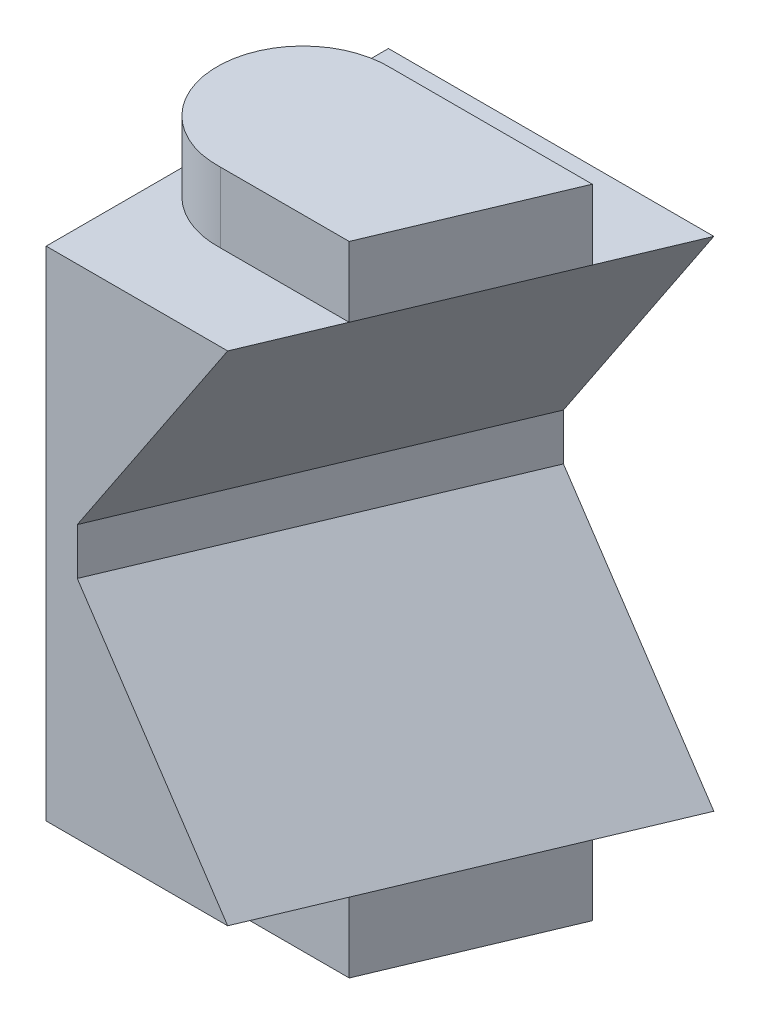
ISO-10303-21;
HEADER;
FILE_DESCRIPTION(('STEP AP214'),'2;1');
FILE_NAME('part.step','',(''),(''),'','','');
FILE_SCHEMA(('AUTOMOTIVE_DESIGN { 1 0 10303 214 1 1 1 1 }'));
ENDSEC;
DATA;
#1=APPLICATION_CONTEXT('core data for automotive mechanical design processes');
#2=APPLICATION_PROTOCOL_DEFINITION('international standard','automotive_design',2000,#1);
#3=PRODUCT_CONTEXT('',#1,'mechanical');
#4=PRODUCT('Part','Part','',(#3));
#5=PRODUCT_RELATED_PRODUCT_CATEGORY('part','',(#4));
#6=PRODUCT_DEFINITION_FORMATION('','',#4);
#7=PRODUCT_DEFINITION_CONTEXT('part definition',#1,'design');
#8=PRODUCT_DEFINITION('design','',#6,#7);
#9=PRODUCT_DEFINITION_SHAPE('','',#8);
#10=(LENGTH_UNIT() NAMED_UNIT(*) SI_UNIT(.MILLI.,.METRE.));
#11=(NAMED_UNIT(*) PLANE_ANGLE_UNIT() SI_UNIT($,.RADIAN.));
#12=(NAMED_UNIT(*) SI_UNIT($,.STERADIAN.) SOLID_ANGLE_UNIT());
#13=UNCERTAINTY_MEASURE_WITH_UNIT(LENGTH_MEASURE(1.E-05),#10,'distance_accuracy_value','');
#14=(GEOMETRIC_REPRESENTATION_CONTEXT(3) GLOBAL_UNCERTAINTY_ASSIGNED_CONTEXT((#13)) GLOBAL_UNIT_ASSIGNED_CONTEXT((#10,
#11,#12)) REPRESENTATION_CONTEXT('',''));
#15=CARTESIAN_POINT('',(0.,0.,0.));
#16=DIRECTION('',(0.,0.,1.));
#17=DIRECTION('',(1.,0.,0.));
#18=AXIS2_PLACEMENT_3D('',#15,#16,#17);
#19=CARTESIAN_POINT('',(21.,16.,0.));
#20=DIRECTION('',(0.,1.,0.));
#21=DIRECTION('',(0.,0.,1.));
#22=AXIS2_PLACEMENT_3D('',#19,#20,#21);
#23=PLANE('',#22);
#24=DIRECTION('',(1.,0.,0.));
#25=VECTOR('',#24,1.);
#26=CARTESIAN_POINT('',(5.70193852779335,16.,5.5));
#27=LINE('',#26,#25);
#28=CARTESIAN_POINT('',(5.70193852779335,16.,5.5));
#29=VERTEX_POINT('',#28);
#30=CARTESIAN_POINT('',(18.6026280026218,16.,5.5));
#31=VERTEX_POINT('',#30);
#32=EDGE_CURVE('E25',#29,#31,#27,.T.);
#33=ORIENTED_EDGE('',*,*,#32,.T.);
#34=DIRECTION('',(-0.3875155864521,0.,0.921863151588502));
#35=VECTOR('',#34,1.);
#36=CARTESIAN_POINT('',(20.9146151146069,16.,0.));
#37=LINE('',#36,#35);
#38=CARTESIAN_POINT('',(20.9146151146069,16.,0.));
#39=VERTEX_POINT('',#38);
#40=EDGE_CURVE('E184',#39,#31,#37,.T.);
#41=ORIENTED_EDGE('',*,*,#40,.F.);
#42=CARTESIAN_POINT('',(20.2479484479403,16.,0.));
#43=DIRECTION('',(1.,0.,0.));
#44=VECTOR('',#43,1.);
#45=LINE('',#42,#44);
#46=CARTESIAN_POINT('',(20.2479484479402,16.,0.));
#47=VERTEX_POINT('',#46);
#48=EDGE_CURVE('E379',#47,#39,#45,.T.);
#49=ORIENTED_EDGE('',*,*,#48,.F.);
#50=DIRECTION('',(-1.,0.,0.));
#51=VECTOR('',#50,1.);
#52=CARTESIAN_POINT('',(20.2479484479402,16.,0.));
#53=LINE('',#52,#51);
#54=CARTESIAN_POINT('',(0.,16.,0.));
#55=VERTEX_POINT('',#54);
#56=EDGE_CURVE('E436',#47,#55,#53,.T.);
#57=ORIENTED_EDGE('',*,*,#56,.T.);
#58=DIRECTION('',(0.,0.,1.));
#59=VECTOR('',#58,1.);
#60=CARTESIAN_POINT('',(0.,16.,22.));
#61=LINE('',#60,#59);
#62=CARTESIAN_POINT('',(0.,16.,11.));
#63=VERTEX_POINT('',#62);
#64=EDGE_CURVE('E437',#55,#63,#61,.T.);
#65=ORIENTED_EDGE('',*,*,#64,.T.);
#66=CARTESIAN_POINT('',(5.50357577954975,16.,11.));
#67=DIRECTION('',(0.,1.,0.));
#68=DIRECTION('',(0.,0.,1.));
#69=AXIS2_PLACEMENT_3D('',#66,#67,#68);
#70=CIRCLE('',#69,5.5035759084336);
#71=EDGE_CURVE('E439',#63,#29,#70,.F.);
#72=ORIENTED_EDGE('',*,*,#71,.T.);
#73=EDGE_LOOP('',(#33,#41,#49,#57,#65,#72));
#74=FACE_BOUND('',#73,.T.);
#75=ADVANCED_FACE('F14',(#74),#23,.T.);
#76=CARTESIAN_POINT('',(13.9786537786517,16.,16.5));
#77=VERTEX_POINT('',#76);
#78=CARTESIAN_POINT('',(11.6666666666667,16.,22.));
#79=VERTEX_POINT('',#78);
#80=EDGE_CURVE('E19',#77,#79,#37,.T.);
#81=ORIENTED_EDGE('',*,*,#80,.F.);
#82=DIRECTION('',(-1.,0.,0.));
#83=VECTOR('',#82,1.);
#84=CARTESIAN_POINT('',(5.70193852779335,16.,16.5));
#85=LINE('',#84,#83);
#86=CARTESIAN_POINT('',(5.70193852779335,16.,16.5));
#87=VERTEX_POINT('',#86);
#88=EDGE_CURVE('E33',#77,#87,#85,.T.);
#89=ORIENTED_EDGE('',*,*,#88,.T.);
#90=EDGE_CURVE('E484',#87,#63,#70,.F.);
#91=ORIENTED_EDGE('',*,*,#90,.T.);
#92=CARTESIAN_POINT('',(0.,16.,22.));
#93=VERTEX_POINT('',#92);
#94=EDGE_CURVE('E435',#63,#93,#61,.T.);
#95=ORIENTED_EDGE('',*,*,#94,.T.);
#96=DIRECTION('',(1.,0.,0.));
#97=VECTOR('',#96,1.);
#98=CARTESIAN_POINT('',(0.,16.,22.));
#99=LINE('',#98,#97);
#100=CARTESIAN_POINT('',(11.,16.,22.));
#101=VERTEX_POINT('',#100);
#102=EDGE_CURVE('E431',#93,#101,#99,.T.);
#103=ORIENTED_EDGE('',*,*,#102,.T.);
#104=CARTESIAN_POINT('',(11.6666666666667,16.,22.));
#105=DIRECTION('',(-1.,0.,0.));
#106=VECTOR('',#105,1.);
#107=LINE('',#104,#106);
#108=EDGE_CURVE('E366',#79,#101,#107,.T.);
#109=ORIENTED_EDGE('',*,*,#108,.F.);
#110=EDGE_LOOP('',(#81,#89,#91,#95,#103,#109));
#111=FACE_BOUND('',#110,.T.);
#112=ADVANCED_FACE('F284',(#111),#23,.T.);
#113=CARTESIAN_POINT('',(21.,-16.,0.));
#114=DIRECTION('',(0.,-1.,0.));
#115=DIRECTION('',(0.,0.,-1.));
#116=AXIS2_PLACEMENT_3D('',#113,#114,#115);
#117=PLANE('',#116);
#118=DIRECTION('',(-0.387515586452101,0.,0.921863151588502));
#119=VECTOR('',#118,1.);
#120=CARTESIAN_POINT('',(20.9146151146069,-16.,0.));
#121=LINE('',#120,#119);
#122=CARTESIAN_POINT('',(20.9146151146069,-16.,0.));
#123=VERTEX_POINT('',#122);
#124=CARTESIAN_POINT('',(18.6026280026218,-16.,5.5));
#125=VERTEX_POINT('',#124);
#126=EDGE_CURVE('E189',#123,#125,#121,.T.);
#127=ORIENTED_EDGE('',*,*,#126,.T.);
#128=DIRECTION('',(1.,0.,0.));
#129=VECTOR('',#128,1.);
#130=CARTESIAN_POINT('',(5.70193852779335,-16.,5.5));
#131=LINE('',#130,#129);
#132=CARTESIAN_POINT('',(5.70193852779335,-16.,5.5));
#133=VERTEX_POINT('',#132);
#134=EDGE_CURVE('E486',#133,#125,#131,.T.);
#135=ORIENTED_EDGE('',*,*,#134,.F.);
#136=CARTESIAN_POINT('',(5.50357577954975,-16.,11.));
#137=DIRECTION('',(0.,-1.,0.));
#138=DIRECTION('',(0.,0.,-1.));
#139=AXIS2_PLACEMENT_3D('',#136,#137,#138);
#140=CIRCLE('',#139,5.5035759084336);
#141=CARTESIAN_POINT('',(0.,-16.,11.));
#142=VERTEX_POINT('',#141);
#143=EDGE_CURVE('E487',#142,#133,#140,.T.);
#144=ORIENTED_EDGE('',*,*,#143,.F.);
#145=DIRECTION('',(0.,0.,-1.));
#146=VECTOR('',#145,1.);
#147=CARTESIAN_POINT('',(0.,-16.,22.));
#148=LINE('',#147,#146);
#149=CARTESIAN_POINT('',(0.,-16.,0.));
#150=VERTEX_POINT('',#149);
#151=EDGE_CURVE('E353',#142,#150,#148,.T.);
#152=ORIENTED_EDGE('',*,*,#151,.T.);
#153=DIRECTION('',(1.,0.,0.));
#154=VECTOR('',#153,1.);
#155=CARTESIAN_POINT('',(0.,-16.,0.));
#156=LINE('',#155,#154);
#157=CARTESIAN_POINT('',(20.2479484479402,-16.,0.));
#158=VERTEX_POINT('',#157);
#159=EDGE_CURVE('E357',#150,#158,#156,.T.);
#160=ORIENTED_EDGE('',*,*,#159,.T.);
#161=CARTESIAN_POINT('',(20.9146151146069,-16.,0.));
#162=DIRECTION('',(-1.,0.,0.));
#163=VECTOR('',#162,1.);
#164=LINE('',#161,#163);
#165=EDGE_CURVE('E256',#123,#158,#164,.T.);
#166=ORIENTED_EDGE('',*,*,#165,.F.);
#167=EDGE_LOOP('',(#127,#135,#144,#152,#160,#166));
#168=FACE_BOUND('',#167,.T.);
#169=ADVANCED_FACE('F273',(#168),#117,.T.);
#170=DIRECTION('',(-1.,0.,0.));
#171=VECTOR('',#170,1.);
#172=CARTESIAN_POINT('',(5.70193852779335,-16.,16.5));
#173=LINE('',#172,#171);
#174=CARTESIAN_POINT('',(13.9786537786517,-16.,16.5));
#175=VERTEX_POINT('',#174);
#176=CARTESIAN_POINT('',(5.70193852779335,-16.,16.5));
#177=VERTEX_POINT('',#176);
#178=EDGE_CURVE('E9',#175,#177,#173,.T.);
#179=ORIENTED_EDGE('',*,*,#178,.F.);
#180=CARTESIAN_POINT('',(11.6666666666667,-16.,22.));
#181=VERTEX_POINT('',#180);
#182=EDGE_CURVE('E186',#175,#181,#121,.T.);
#183=ORIENTED_EDGE('',*,*,#182,.T.);
#184=CARTESIAN_POINT('',(11.,-16.,22.));
#185=DIRECTION('',(1.,0.,0.));
#186=VECTOR('',#185,1.);
#187=LINE('',#184,#186);
#188=CARTESIAN_POINT('',(11.,-16.,22.));
#189=VERTEX_POINT('',#188);
#190=EDGE_CURVE('E242',#189,#181,#187,.T.);
#191=ORIENTED_EDGE('',*,*,#190,.F.);
#192=DIRECTION('',(-1.,0.,0.));
#193=VECTOR('',#192,1.);
#194=CARTESIAN_POINT('',(11.,-16.,22.));
#195=LINE('',#194,#193);
#196=CARTESIAN_POINT('',(0.,-16.,22.));
#197=VERTEX_POINT('',#196);
#198=EDGE_CURVE('E351',#189,#197,#195,.T.);
#199=ORIENTED_EDGE('',*,*,#198,.T.);
#200=EDGE_CURVE('E196',#197,#142,#148,.T.);
#201=ORIENTED_EDGE('',*,*,#200,.T.);
#202=EDGE_CURVE('E359',#177,#142,#140,.T.);
#203=ORIENTED_EDGE('',*,*,#202,.F.);
#204=EDGE_LOOP('',(#179,#183,#191,#199,#201,#203));
#205=FACE_BOUND('',#204,.T.);
#206=ADVANCED_FACE('F283',(#205),#117,.T.);
#207=CARTESIAN_POINT('',(0.,15.,0.));
#208=DIRECTION('',(0.,0.,-1.));
#209=DIRECTION('',(-1.,0.,0.));
#210=AXIS2_PLACEMENT_3D('',#207,#208,#209);
#211=PLANE('',#210);
#212=DIRECTION('',(-0.554700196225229,0.832050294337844,0.));
#213=VECTOR('',#212,1.);
#214=CARTESIAN_POINT('',(20.2479484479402,-15.,0.));
#215=LINE('',#214,#213);
#216=CARTESIAN_POINT('',(20.2479484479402,-15.,0.));
#217=VERTEX_POINT('',#216);
#218=CARTESIAN_POINT('',(11.2479484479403,-1.5,0.));
#219=VERTEX_POINT('',#218);
#220=EDGE_CURVE('E329',#217,#219,#215,.T.);
#221=ORIENTED_EDGE('',*,*,#220,.F.);
#222=CARTESIAN_POINT('',(20.2479484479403,-15.,0.));
#223=DIRECTION('',(0.554700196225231,-0.832050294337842,0.));
#224=VECTOR('',#223,1.);
#225=LINE('',#222,#224);
#226=EDGE_CURVE('E193',#217,#123,#225,.T.);
#227=ORIENTED_EDGE('',*,*,#226,.T.);
#228=ORIENTED_EDGE('',*,*,#165,.T.);
#229=ORIENTED_EDGE('',*,*,#159,.F.);
#230=DIRECTION('',(0.,1.,0.));
#231=VECTOR('',#230,1.);
#232=CARTESIAN_POINT('',(0.,-15.,0.));
#233=LINE('',#232,#231);
#234=EDGE_CURVE('E470',#150,#55,#233,.T.);
#235=ORIENTED_EDGE('',*,*,#234,.T.);
#236=ORIENTED_EDGE('',*,*,#56,.F.);
#237=ORIENTED_EDGE('',*,*,#48,.T.);
#238=CARTESIAN_POINT('',(20.9146151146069,16.,0.));
#239=DIRECTION('',(-0.554700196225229,-0.832050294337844,0.));
#240=VECTOR('',#239,1.);
#241=LINE('',#238,#240);
#242=CARTESIAN_POINT('',(20.2479484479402,15.,0.));
#243=VERTEX_POINT('',#242);
#244=EDGE_CURVE('E354',#39,#243,#241,.T.);
#245=ORIENTED_EDGE('',*,*,#244,.T.);
#246=DIRECTION('',(-0.554700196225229,-0.832050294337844,0.));
#247=VECTOR('',#246,1.);
#248=CARTESIAN_POINT('',(20.2479484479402,15.,0.));
#249=LINE('',#248,#247);
#250=CARTESIAN_POINT('',(11.2479484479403,1.5,0.));
#251=VERTEX_POINT('',#250);
#252=EDGE_CURVE('E450',#243,#251,#249,.T.);
#253=ORIENTED_EDGE('',*,*,#252,.T.);
#254=DIRECTION('',(0.,1.,0.));
#255=VECTOR('',#254,1.);
#256=CARTESIAN_POINT('',(11.2479484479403,-1.5,0.));
#257=LINE('',#256,#255);
#258=EDGE_CURVE('E332',#219,#251,#257,.T.);
#259=ORIENTED_EDGE('',*,*,#258,.F.);
#260=EDGE_LOOP('',(#221,#227,#228,#229,#235,#236,#237,#245,#253,#259));
#261=FACE_BOUND('',#260,.T.);
#262=ADVANCED_FACE('F16',(#261),#211,.T.);
#263=CARTESIAN_POINT('',(11.,15.,22.));
#264=DIRECTION('',(0.,0.,1.));
#265=DIRECTION('',(1.,0.,0.));
#266=AXIS2_PLACEMENT_3D('',#263,#264,#265);
#267=PLANE('',#266);
#268=DIRECTION('',(-0.554700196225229,-0.832050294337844,0.));
#269=VECTOR('',#268,1.);
#270=CARTESIAN_POINT('',(11.,15.,22.));
#271=LINE('',#270,#269);
#272=CARTESIAN_POINT('',(11.,15.,22.));
#273=VERTEX_POINT('',#272);
#274=CARTESIAN_POINT('',(2.,1.5,22.));
#275=VERTEX_POINT('',#274);
#276=EDGE_CURVE('E448',#273,#275,#271,.T.);
#277=ORIENTED_EDGE('',*,*,#276,.F.);
#278=CARTESIAN_POINT('',(11.,15.,22.));
#279=DIRECTION('',(0.554700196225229,0.832050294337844,0.));
#280=VECTOR('',#279,1.);
#281=LINE('',#278,#280);
#282=EDGE_CURVE('E180',#273,#79,#281,.T.);
#283=ORIENTED_EDGE('',*,*,#282,.T.);
#284=ORIENTED_EDGE('',*,*,#108,.T.);
#285=ORIENTED_EDGE('',*,*,#102,.F.);
#286=DIRECTION('',(0.,-1.,0.));
#287=VECTOR('',#286,1.);
#288=CARTESIAN_POINT('',(0.,15.,22.));
#289=LINE('',#288,#287);
#290=EDGE_CURVE('E472',#93,#197,#289,.T.);
#291=ORIENTED_EDGE('',*,*,#290,.T.);
#292=ORIENTED_EDGE('',*,*,#198,.F.);
#293=ORIENTED_EDGE('',*,*,#190,.T.);
#294=CARTESIAN_POINT('',(11.6666666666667,-16.,22.));
#295=DIRECTION('',(-0.55470019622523,0.832050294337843,0.));
#296=VECTOR('',#295,1.);
#297=LINE('',#294,#296);
#298=CARTESIAN_POINT('',(11.,-15.,22.));
#299=VERTEX_POINT('',#298);
#300=EDGE_CURVE('E666',#181,#299,#297,.T.);
#301=ORIENTED_EDGE('',*,*,#300,.T.);
#302=DIRECTION('',(-0.554700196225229,0.832050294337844,0.));
#303=VECTOR('',#302,1.);
#304=CARTESIAN_POINT('',(11.,-15.,22.));
#305=LINE('',#304,#303);
#306=CARTESIAN_POINT('',(2.,-1.5,22.));
#307=VERTEX_POINT('',#306);
#308=EDGE_CURVE('E334',#299,#307,#305,.T.);
#309=ORIENTED_EDGE('',*,*,#308,.T.);
#310=DIRECTION('',(0.,1.,0.));
#311=VECTOR('',#310,1.);
#312=CARTESIAN_POINT('',(2.,-1.5,22.));
#313=LINE('',#312,#311);
#314=EDGE_CURVE('E459',#307,#275,#313,.T.);
#315=ORIENTED_EDGE('',*,*,#314,.T.);
#316=EDGE_LOOP('',(#277,#283,#284,#285,#291,#292,#293,#301,#309,#315));
#317=FACE_BOUND('',#316,.T.);
#318=ADVANCED_FACE('F205',(#317),#267,.T.);
#319=CARTESIAN_POINT('',(20.2479484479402,15.,0.));
#320=DIRECTION('',(0.785395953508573,-0.523597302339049,0.330150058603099));
#321=DIRECTION('',(0.554700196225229,0.832050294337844,0.));
#322=AXIS2_PLACEMENT_3D('',#319,#320,#321);
#323=PLANE('',#322);
#324=ORIENTED_EDGE('',*,*,#252,.F.);
#325=ORIENTED_EDGE('',*,*,#244,.F.);
#326=ORIENTED_EDGE('',*,*,#40,.T.);
#327=DIRECTION('',(0.387515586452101,0.,-0.921863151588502));
#328=VECTOR('',#327,1.);
#329=CARTESIAN_POINT('',(13.9786537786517,16.,16.5));
#330=LINE('',#329,#328);
#331=EDGE_CURVE('E162',#77,#31,#330,.T.);
#332=ORIENTED_EDGE('',*,*,#331,.F.);
#333=ORIENTED_EDGE('',*,*,#80,.T.);
#334=ORIENTED_EDGE('',*,*,#282,.F.);
#335=ORIENTED_EDGE('',*,*,#276,.T.);
#336=DIRECTION('',(0.387515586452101,0.,-0.921863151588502));
#337=VECTOR('',#336,1.);
#338=CARTESIAN_POINT('',(2.,1.5,22.));
#339=LINE('',#338,#337);
#340=EDGE_CURVE('E451',#275,#251,#339,.T.);
#341=ORIENTED_EDGE('',*,*,#340,.T.);
#342=EDGE_LOOP('',(#324,#325,#326,#332,#333,#334,#335,#341));
#343=FACE_BOUND('',#342,.T.);
#344=ADVANCED_FACE('F214',(#343),#323,.T.);
#345=CARTESIAN_POINT('',(11.2479484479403,-1.5,0.));
#346=DIRECTION('',(-0.921863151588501,0.,-0.387515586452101));
#347=DIRECTION('',(-0.387515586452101,0.,0.921863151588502));
#348=AXIS2_PLACEMENT_3D('',#345,#346,#347);
#349=PLANE('',#348);
#350=ORIENTED_EDGE('',*,*,#314,.F.);
#351=DIRECTION('',(-0.387515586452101,0.,0.921863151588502));
#352=VECTOR('',#351,1.);
#353=CARTESIAN_POINT('',(11.2479484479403,-1.5,0.));
#354=LINE('',#353,#352);
#355=EDGE_CURVE('E338',#219,#307,#354,.T.);
#356=ORIENTED_EDGE('',*,*,#355,.F.);
#357=ORIENTED_EDGE('',*,*,#258,.T.);
#358=ORIENTED_EDGE('',*,*,#340,.F.);
#359=EDGE_LOOP('',(#350,#356,#357,#358));
#360=FACE_BOUND('',#359,.T.);
#361=ADVANCED_FACE('F216',(#360),#349,.F.);
#362=CARTESIAN_POINT('',(11.,-15.,22.));
#363=DIRECTION('',(0.785395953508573,0.523597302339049,0.330150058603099));
#364=DIRECTION('',(-0.554700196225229,0.832050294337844,0.));
#365=AXIS2_PLACEMENT_3D('',#362,#363,#364);
#366=PLANE('',#365);
#367=ORIENTED_EDGE('',*,*,#308,.F.);
#368=ORIENTED_EDGE('',*,*,#300,.F.);
#369=ORIENTED_EDGE('',*,*,#182,.F.);
#370=DIRECTION('',(-0.387515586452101,0.,0.921863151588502));
#371=VECTOR('',#370,1.);
#372=CARTESIAN_POINT('',(13.9786537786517,-16.,16.5));
#373=LINE('',#372,#371);
#374=EDGE_CURVE('E171',#125,#175,#373,.T.);
#375=ORIENTED_EDGE('',*,*,#374,.F.);
#376=ORIENTED_EDGE('',*,*,#126,.F.);
#377=ORIENTED_EDGE('',*,*,#226,.F.);
#378=ORIENTED_EDGE('',*,*,#220,.T.);
#379=ORIENTED_EDGE('',*,*,#355,.T.);
#380=EDGE_LOOP('',(#367,#368,#369,#375,#376,#377,#378,#379));
#381=FACE_BOUND('',#380,.T.);
#382=ADVANCED_FACE('F305',(#381),#366,.T.);
#383=CARTESIAN_POINT('',(5.50357577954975,-19.5,11.));
#384=DIRECTION('',(0.,1.,0.));
#385=DIRECTION('',(0.,0.,1.));
#386=AXIS2_PLACEMENT_3D('',#383,#384,#385);
#387=CYLINDRICAL_SURFACE('',#386,5.5035759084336);
#388=ORIENTED_EDGE('',*,*,#202,.T.);
#389=ORIENTED_EDGE('',*,*,#143,.T.);
#390=DIRECTION('',(0.,1.,0.));
#391=VECTOR('',#390,1.);
#392=CARTESIAN_POINT('',(5.70193852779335,-19.5,5.5));
#393=LINE('',#392,#391);
#394=CARTESIAN_POINT('',(5.70193852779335,-20.5,5.5));
#395=VERTEX_POINT('',#394);
#396=EDGE_CURVE('E335',#395,#133,#393,.T.);
#397=ORIENTED_EDGE('',*,*,#396,.F.);
#398=CARTESIAN_POINT('',(5.50357577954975,-20.5,11.));
#399=DIRECTION('',(0.,-1.,0.));
#400=DIRECTION('',(0.,0.,-1.));
#401=AXIS2_PLACEMENT_3D('',#398,#399,#400);
#402=CIRCLE('',#401,5.5035759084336);
#403=CARTESIAN_POINT('',(5.70193852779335,-20.5,16.5));
#404=VERTEX_POINT('',#403);
#405=EDGE_CURVE('E478',#404,#395,#402,.T.);
#406=ORIENTED_EDGE('',*,*,#405,.F.);
#407=DIRECTION('',(0.,1.,0.));
#408=VECTOR('',#407,1.);
#409=CARTESIAN_POINT('',(5.70193852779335,-19.5,16.5));
#410=LINE('',#409,#408);
#411=EDGE_CURVE('E341',#404,#177,#410,.T.);
#412=ORIENTED_EDGE('',*,*,#411,.T.);
#413=EDGE_LOOP('',(#388,#389,#397,#406,#412));
#414=FACE_BOUND('',#413,.T.);
#415=ADVANCED_FACE('F314',(#414),#387,.T.);
#416=CARTESIAN_POINT('',(5.70193852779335,-19.5,5.5));
#417=DIRECTION('',(0.,0.,1.));
#418=DIRECTION('',(1.,0.,0.));
#419=AXIS2_PLACEMENT_3D('',#416,#417,#418);
#420=PLANE('',#419);
#421=DIRECTION('',(0.,1.,0.));
#422=VECTOR('',#421,1.);
#423=CARTESIAN_POINT('',(18.6026280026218,-33.8423490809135,5.5));
#424=LINE('',#423,#422);
#425=CARTESIAN_POINT('',(18.6026280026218,-20.5,5.5));
#426=VERTEX_POINT('',#425);
#427=EDGE_CURVE('E168',#426,#125,#424,.T.);
#428=ORIENTED_EDGE('',*,*,#427,.F.);
#429=DIRECTION('',(1.,0.,0.));
#430=VECTOR('',#429,1.);
#431=CARTESIAN_POINT('',(5.70193852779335,-20.5,5.5));
#432=LINE('',#431,#430);
#433=EDGE_CURVE('E476',#395,#426,#432,.T.);
#434=ORIENTED_EDGE('',*,*,#433,.F.);
#435=ORIENTED_EDGE('',*,*,#396,.T.);
#436=ORIENTED_EDGE('',*,*,#134,.T.);
#437=EDGE_LOOP('',(#428,#434,#435,#436));
#438=FACE_BOUND('',#437,.T.);
#439=ADVANCED_FACE('F497',(#438),#420,.F.);
#440=CARTESIAN_POINT('',(5.70193852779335,-19.5,16.5));
#441=DIRECTION('',(0.,0.,-1.));
#442=DIRECTION('',(-1.,0.,0.));
#443=AXIS2_PLACEMENT_3D('',#440,#441,#442);
#444=PLANE('',#443);
#445=ORIENTED_EDGE('',*,*,#178,.T.);
#446=ORIENTED_EDGE('',*,*,#411,.F.);
#447=DIRECTION('',(-1.,0.,0.));
#448=VECTOR('',#447,1.);
#449=CARTESIAN_POINT('',(13.3119871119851,-20.5,16.5));
#450=LINE('',#449,#448);
#451=CARTESIAN_POINT('',(13.9786537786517,-20.5,16.5));
#452=VERTEX_POINT('',#451);
#453=EDGE_CURVE('E474',#452,#404,#450,.T.);
#454=ORIENTED_EDGE('',*,*,#453,.F.);
#455=DIRECTION('',(0.,1.,0.));
#456=VECTOR('',#455,1.);
#457=CARTESIAN_POINT('',(13.9786537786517,-33.8423490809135,16.5));
#458=LINE('',#457,#456);
#459=EDGE_CURVE('E177',#452,#175,#458,.T.);
#460=ORIENTED_EDGE('',*,*,#459,.T.);
#461=EDGE_LOOP('',(#445,#446,#454,#460));
#462=FACE_BOUND('',#461,.T.);
#463=ADVANCED_FACE('F582',(#462),#444,.F.);
#464=CARTESIAN_POINT('',(5.50357577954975,19.5,11.));
#465=DIRECTION('',(0.,-1.,0.));
#466=DIRECTION('',(0.,0.,-1.));
#467=AXIS2_PLACEMENT_3D('',#464,#465,#466);
#468=CYLINDRICAL_SURFACE('',#467,5.5035759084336);
#469=ORIENTED_EDGE('',*,*,#71,.F.);
#470=ORIENTED_EDGE('',*,*,#90,.F.);
#471=DIRECTION('',(0.,-1.,0.));
#472=VECTOR('',#471,1.);
#473=CARTESIAN_POINT('',(5.70193852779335,19.5,16.5));
#474=LINE('',#473,#472);
#475=CARTESIAN_POINT('',(5.70193852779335,20.5,16.5));
#476=VERTEX_POINT('',#475);
#477=EDGE_CURVE('E465',#476,#87,#474,.T.);
#478=ORIENTED_EDGE('',*,*,#477,.F.);
#479=CARTESIAN_POINT('',(5.50357577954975,20.5,11.));
#480=DIRECTION('',(0.,1.,0.));
#481=DIRECTION('',(0.,0.,1.));
#482=AXIS2_PLACEMENT_3D('',#479,#480,#481);
#483=CIRCLE('',#482,5.5035759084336);
#484=CARTESIAN_POINT('',(5.70193852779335,20.5,5.5));
#485=VERTEX_POINT('',#484);
#486=EDGE_CURVE('E154',#485,#476,#483,.T.);
#487=ORIENTED_EDGE('',*,*,#486,.F.);
#488=DIRECTION('',(0.,-1.,0.));
#489=VECTOR('',#488,1.);
#490=CARTESIAN_POINT('',(5.70193852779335,19.5,5.5));
#491=LINE('',#490,#489);
#492=EDGE_CURVE('E467',#485,#29,#491,.T.);
#493=ORIENTED_EDGE('',*,*,#492,.T.);
#494=EDGE_LOOP('',(#469,#470,#478,#487,#493));
#495=FACE_BOUND('',#494,.T.);
#496=ADVANCED_FACE('F590',(#495),#468,.T.);
#497=CARTESIAN_POINT('',(5.70193852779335,19.5,16.5));
#498=DIRECTION('',(0.,0.,1.));
#499=DIRECTION('',(1.,0.,0.));
#500=AXIS2_PLACEMENT_3D('',#497,#498,#499);
#501=PLANE('',#500);
#502=DIRECTION('',(0.,-1.,0.));
#503=VECTOR('',#502,1.);
#504=CARTESIAN_POINT('',(13.9786537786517,33.9946779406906,16.5));
#505=LINE('',#504,#503);
#506=CARTESIAN_POINT('',(13.9786537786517,20.5,16.5));
#507=VERTEX_POINT('',#506);
#508=EDGE_CURVE('E157',#507,#77,#505,.T.);
#509=ORIENTED_EDGE('',*,*,#508,.F.);
#510=DIRECTION('',(1.,0.,0.));
#511=VECTOR('',#510,1.);
#512=CARTESIAN_POINT('',(5.70193852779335,20.5,16.5));
#513=LINE('',#512,#511);
#514=EDGE_CURVE('E149',#476,#507,#513,.T.);
#515=ORIENTED_EDGE('',*,*,#514,.F.);
#516=ORIENTED_EDGE('',*,*,#477,.T.);
#517=ORIENTED_EDGE('',*,*,#88,.F.);
#518=EDGE_LOOP('',(#509,#515,#516,#517));
#519=FACE_BOUND('',#518,.T.);
#520=ADVANCED_FACE('F158',(#519),#501,.T.);
#521=CARTESIAN_POINT('',(5.70193852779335,19.5,5.5));
#522=DIRECTION('',(0.,0.,-1.));
#523=DIRECTION('',(-1.,0.,0.));
#524=AXIS2_PLACEMENT_3D('',#521,#522,#523);
#525=PLANE('',#524);
#526=DIRECTION('',(0.,-1.,0.));
#527=VECTOR('',#526,1.);
#528=CARTESIAN_POINT('',(18.6026280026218,33.9946779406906,5.5));
#529=LINE('',#528,#527);
#530=CARTESIAN_POINT('',(18.6026280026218,20.5,5.5));
#531=VERTEX_POINT('',#530);
#532=EDGE_CURVE('E163',#531,#31,#529,.T.);
#533=ORIENTED_EDGE('',*,*,#532,.T.);
#534=ORIENTED_EDGE('',*,*,#32,.F.);
#535=ORIENTED_EDGE('',*,*,#492,.F.);
#536=DIRECTION('',(-1.,0.,0.));
#537=VECTOR('',#536,1.);
#538=CARTESIAN_POINT('',(17.9359613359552,20.5,5.5));
#539=LINE('',#538,#537);
#540=EDGE_CURVE('E155',#531,#485,#539,.T.);
#541=ORIENTED_EDGE('',*,*,#540,.F.);
#542=EDGE_LOOP('',(#533,#534,#535,#541));
#543=FACE_BOUND('',#542,.T.);
#544=ADVANCED_FACE('F609',(#543),#525,.T.);
#545=CARTESIAN_POINT('',(0.,15.,22.));
#546=DIRECTION('',(1.,0.,0.));
#547=DIRECTION('',(0.,0.,-1.));
#548=AXIS2_PLACEMENT_3D('',#545,#546,#547);
#549=PLANE('',#548);
#550=ORIENTED_EDGE('',*,*,#94,.F.);
#551=ORIENTED_EDGE('',*,*,#64,.F.);
#552=ORIENTED_EDGE('',*,*,#234,.F.);
#553=ORIENTED_EDGE('',*,*,#151,.F.);
#554=ORIENTED_EDGE('',*,*,#200,.F.);
#555=ORIENTED_EDGE('',*,*,#290,.F.);
#556=EDGE_LOOP('',(#550,#551,#552,#553,#554,#555));
#557=FACE_BOUND('',#556,.T.);
#558=ADVANCED_FACE('F500',(#557),#549,.F.);
#559=CARTESIAN_POINT('',(5.50357577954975,-20.5,11.));
#560=DIRECTION('',(0.,-1.,0.));
#561=DIRECTION('',(0.,0.,-1.));
#562=AXIS2_PLACEMENT_3D('',#559,#560,#561);
#563=PLANE('',#562);
#564=ORIENTED_EDGE('',*,*,#453,.T.);
#565=ORIENTED_EDGE('',*,*,#405,.T.);
#566=ORIENTED_EDGE('',*,*,#433,.T.);
#567=DIRECTION('',(-0.387515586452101,0.,0.921863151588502));
#568=VECTOR('',#567,1.);
#569=CARTESIAN_POINT('',(13.9786537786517,-20.5,16.5));
#570=LINE('',#569,#568);
#571=EDGE_CURVE('E178',#426,#452,#570,.T.);
#572=ORIENTED_EDGE('',*,*,#571,.T.);
#573=EDGE_LOOP('',(#564,#565,#566,#572));
#574=FACE_BOUND('',#573,.T.);
#575=ADVANCED_FACE('F627',(#574),#563,.T.);
#576=CARTESIAN_POINT('',(5.50357577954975,20.5,11.));
#577=DIRECTION('',(0.,1.,0.));
#578=DIRECTION('',(0.,0.,1.));
#579=AXIS2_PLACEMENT_3D('',#576,#577,#578);
#580=PLANE('',#579);
#581=ORIENTED_EDGE('',*,*,#540,.T.);
#582=ORIENTED_EDGE('',*,*,#486,.T.);
#583=ORIENTED_EDGE('',*,*,#514,.T.);
#584=DIRECTION('',(0.387515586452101,0.,-0.921863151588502));
#585=VECTOR('',#584,1.);
#586=CARTESIAN_POINT('',(13.9786537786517,20.5,16.5));
#587=LINE('',#586,#585);
#588=EDGE_CURVE('E152',#507,#531,#587,.T.);
#589=ORIENTED_EDGE('',*,*,#588,.T.);
#590=EDGE_LOOP('',(#581,#582,#583,#589));
#591=FACE_BOUND('',#590,.T.);
#592=ADVANCED_FACE('F150',(#591),#580,.T.);
#593=CARTESIAN_POINT('',(13.9786537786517,-33.8423490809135,16.5));
#594=DIRECTION('',(-0.921863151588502,0.,-0.387515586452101));
#595=DIRECTION('',(-0.387515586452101,0.,0.921863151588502));
#596=AXIS2_PLACEMENT_3D('',#593,#594,#595);
#597=PLANE('',#596);
#598=ORIENTED_EDGE('',*,*,#571,.F.);
#599=ORIENTED_EDGE('',*,*,#427,.T.);
#600=ORIENTED_EDGE('',*,*,#374,.T.);
#601=ORIENTED_EDGE('',*,*,#459,.F.);
#602=EDGE_LOOP('',(#598,#599,#600,#601));
#603=FACE_BOUND('',#602,.T.);
#604=ADVANCED_FACE('F286',(#603),#597,.F.);
#605=CARTESIAN_POINT('',(13.9786537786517,33.9946779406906,16.5));
#606=DIRECTION('',(-0.921863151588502,0.,-0.387515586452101));
#607=DIRECTION('',(-0.387515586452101,0.,0.921863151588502));
#608=AXIS2_PLACEMENT_3D('',#605,#606,#607);
#609=PLANE('',#608);
#610=ORIENTED_EDGE('',*,*,#588,.F.);
#611=ORIENTED_EDGE('',*,*,#508,.T.);
#612=ORIENTED_EDGE('',*,*,#331,.T.);
#613=ORIENTED_EDGE('',*,*,#532,.F.);
#614=EDGE_LOOP('',(#610,#611,#612,#613));
#615=FACE_BOUND('',#614,.T.);
#616=ADVANCED_FACE('F166',(#615),#609,.F.);
#617=CLOSED_SHELL('',(#75,#112,#169,#206,#262,#318,#344,#361,#382,#415,#439,#463,#496,#520,#544,
#558,#575,#592,#604,#616));
#618=MANIFOLD_SOLID_BREP('B1',#617);
#619=ADVANCED_BREP_SHAPE_REPRESENTATION('',(#18,#618),#14);
#620=SHAPE_DEFINITION_REPRESENTATION(#9,#619);
ENDSEC;
END-ISO-10303-21;
